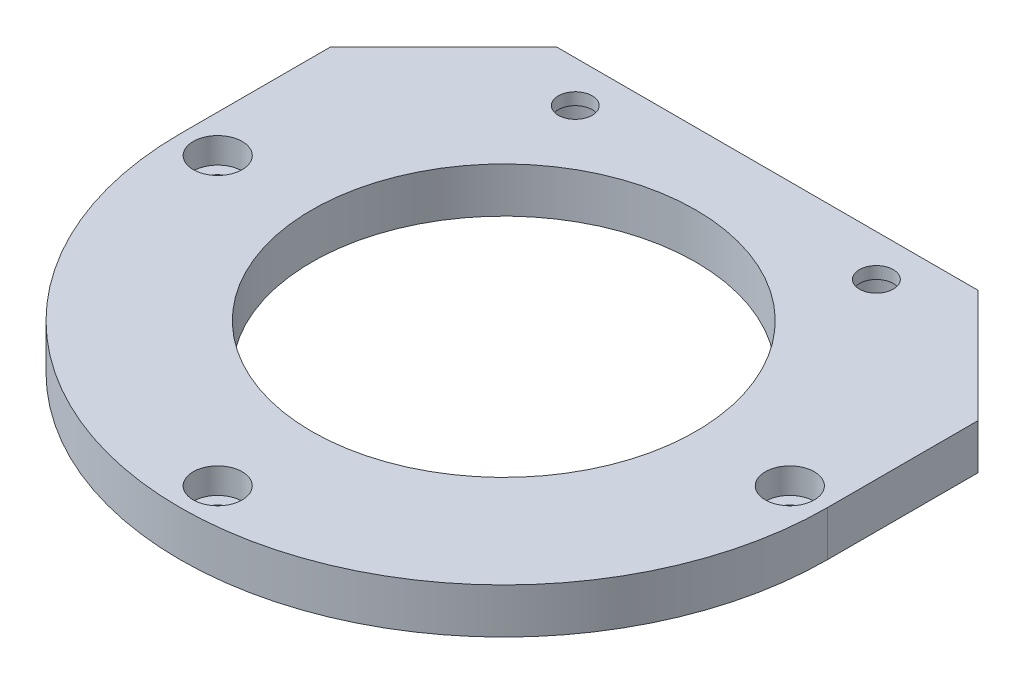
from build123d import *

# Parameters (mm, degrees)
SKETCH1_W                                           = 86
SKETCH1_H                                           = 78
EXTRUDE1_DEPTH                                      = 6
HOLEWZD1_D                                          = 51
CBORE_FOR_M3_HEX_SOCKET_HEAD_CAP_SCREW1_D           = 3.4
CBORE_FOR_M3_HEX_SOCKET_HEAD_CAP_SCREW1_CBORE_D     = 6.5
CBORE_FOR_M3_HEX_SOCKET_HEAD_CAP_SCREW1_CBORE_DEPTH = 3.4
CBORE_FOR_M4_HEX_SOCKET_HEAD_CAP_SCREW1_D           = 4.5
CBORE_FOR_M4_HEX_SOCKET_HEAD_CAP_SCREW1_CBORE_D     = 8
CBORE_FOR_M4_HEX_SOCKET_HEAD_CAP_SCREW1_CBORE_DEPTH = 4.4
CHAMFER1_SIZE                                       = 15
FILLET1_RADIUS                                      = 43
FILLET1_LENGTH                                      = 6


with BuildPart() as part:
    # Sketch1 → Extrude1 (new body)
    with BuildSketch(Plane(origin=(0, 0, 0), x_dir=(1, 0, 0), z_dir=(0, 1, 0))):
        with Locations((0, -4)):
            Rectangle(SKETCH1_W, SKETCH1_H)
    extrude(amount=EXTRUDE1_DEPTH)

    # HoleWzd1 (through all)
    with Locations(Plane(origin=(0, 6, 0), x_dir=(1, 0, 0), z_dir=(0, 1, 0))):
        with Locations((0, 0)):
            Hole(HOLEWZD1_D / 2)

    # CBORE for M3 Hex Socket Head Cap Screw1 (through all)
    with Locations(Plane(origin=(0, 6, 0), x_dir=(1, 0, 0), z_dir=(0, 1, 0))):
        with Locations((-38, 0), (0, -38), (38, 0)):
            CounterBoreHole(CBORE_FOR_M3_HEX_SOCKET_HEAD_CAP_SCREW1_D / 2, CBORE_FOR_M3_HEX_SOCKET_HEAD_CAP_SCREW1_CBORE_D / 2, CBORE_FOR_M3_HEX_SOCKET_HEAD_CAP_SCREW1_CBORE_DEPTH)

    # CBORE for M4 Hex Socket Head Cap Screw1 (through all)
    with Locations(Plane(origin=(0, 0, 0), x_dir=(-1, 0, 0), z_dir=(0, -1, 0))):
        with Locations((-20, 29.5), (20, 29.5)):
            CounterBoreHole(CBORE_FOR_M4_HEX_SOCKET_HEAD_CAP_SCREW1_D / 2, CBORE_FOR_M4_HEX_SOCKET_HEAD_CAP_SCREW1_CBORE_D / 2, CBORE_FOR_M4_HEX_SOCKET_HEAD_CAP_SCREW1_CBORE_DEPTH)

    # Chamfer1
    chamfer1_edges = [part.edges().sort_by_distance(p)[0] for p in [
        (-43, 3, -35),
        (43, 3, -35),
    ]]
    chamfer(chamfer1_edges, length=CHAMFER1_SIZE)

    # Fillet1: full round fillet: the end face becomes a half cylinder, R = half its width
    fillet1_face = Plane((0, 3, 43), x_dir=(0, 1, 0), z_dir=(0, 0, 1))  # on the end face: x along it, z out of the body
    fillet1_slab = fillet1_face.offset(-FILLET1_RADIUS / 2) * Box(FILLET1_LENGTH, 2 * FILLET1_RADIUS, FILLET1_RADIUS, mode=Mode.PRIVATE)  # the body's end, R deep
    fillet1_round = Plane((0, 3, 0), x_dir=(0, 0, 1), z_dir=(0, 1, 0)) * Cylinder(FILLET1_RADIUS, FILLET1_LENGTH, mode=Mode.PRIVATE)  # its axis R under the face
    add(fillet1_slab - fillet1_round, mode=Mode.SUBTRACT)


solid = part.part
